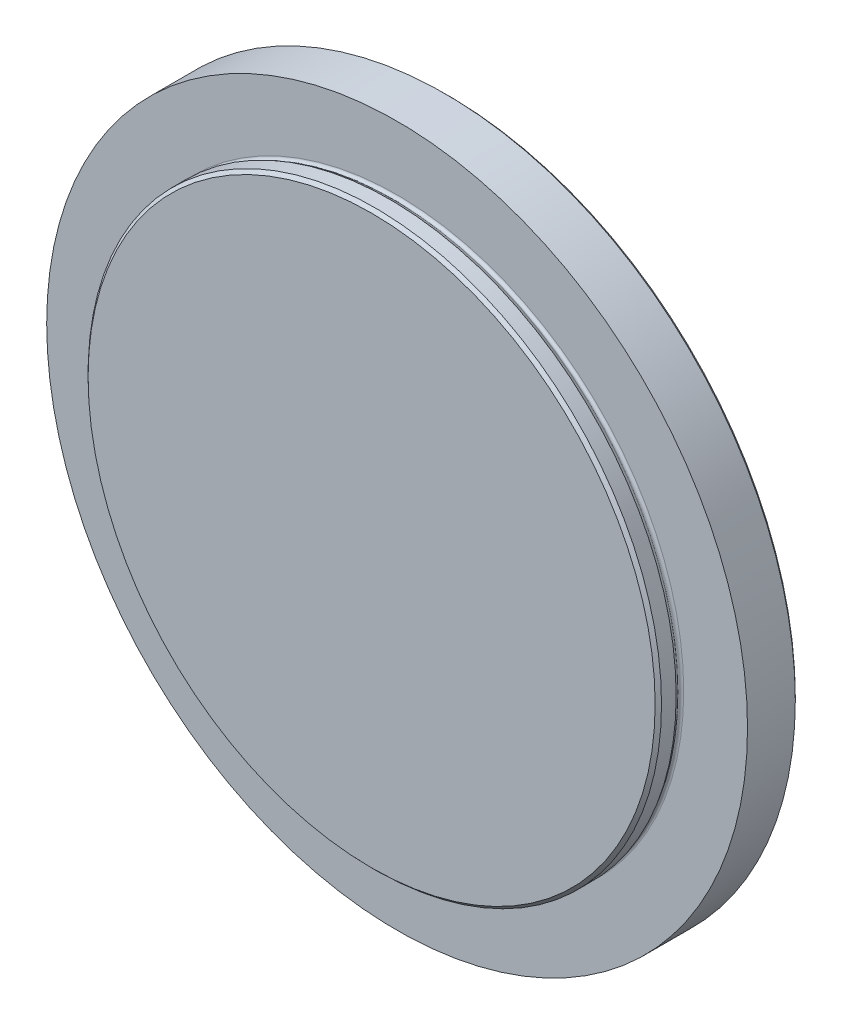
from build123d import *


with BuildPart() as part:
    # Sketch1 → Revolve1 (revolve)
    with BuildSketch(Plane(origin=(0, -18, -1.35), x_dir=(0, 0, -1), z_dir=(1, 0, 0)), mode=Mode.PRIVATE) as revolve1_sk:
        Polygon((-5.35, 18), (6.65, 18), (6.65, 63), (-4.85, 63), (-5.35, 62.5), align=None)
    revolve(revolve1_sk.sketch.rotate(Axis((0, 0, -8), (0, 0, -1)), 90), axis=Axis((0, 0, -8), (0, 0, -1)))

    # Sketch2 → Revolve2 (revolve)
    with BuildSketch(Plane(origin=(0, 0, 0), x_dir=(0, 0, -1), z_dir=(1, 0, 0)), mode=Mode.PRIVATE) as revolve2_sk:
        Polygon((7.5, 55), (8, 54.5), (8, 45), (0, 45), (0, 55), align=None)
    revolve(revolve2_sk.sketch.rotate(Axis((0, 0, -8), (0, 0, -1)), 90), axis=Axis((0, 0, -8), (0, 0, -1)))

    # Sketch3 → Cut-Revolve1 (revolve, cut)
    with BuildSketch(Plane(origin=(0, 0, 0), x_dir=(0, 0, -1), z_dir=(1, 0, 0)), mode=Mode.PRIVATE) as cut_revolve1_sk:
        with BuildLine():
            Line((-1.2, 45), (0, 45))
            Line((0, 45), (0, 44.985964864))
            ThreePointArc((0, 44.985964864), (-0.203030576, 44.637822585), (-0.60601523, 44.643097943))
            Line((-0.60601523, 44.643097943), (-1.2, 45))
        make_face()
    revolve(cut_revolve1_sk.sketch.rotate(Axis((0, 0, -8), (0, 0, -1)), 90), axis=Axis((0, 0, -8), (0, 0, -1)), mode=Mode.SUBTRACT)


solid = part.part
